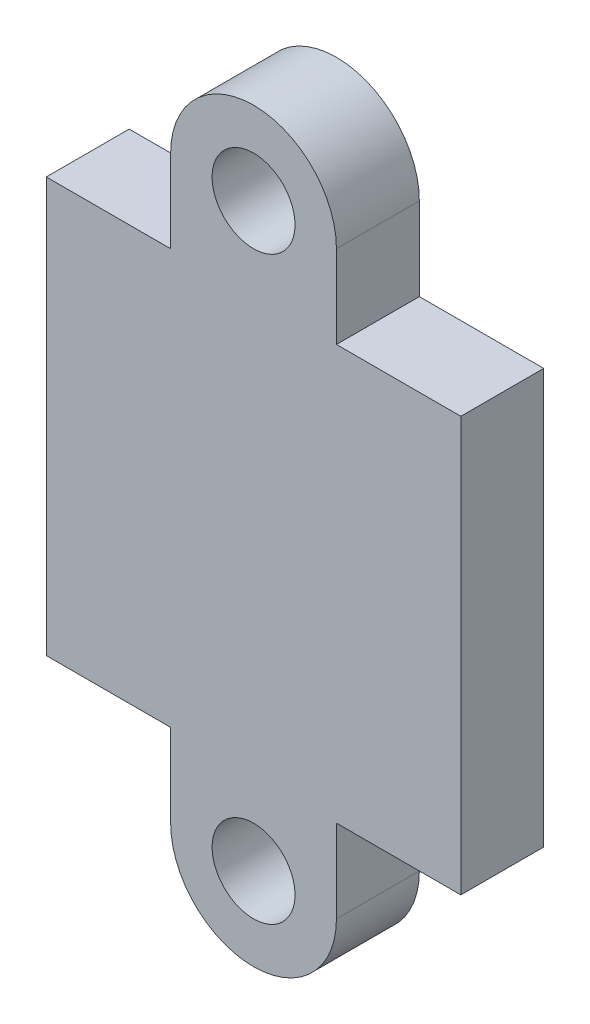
ISO-10303-21;
HEADER;
FILE_DESCRIPTION(('STEP AP214'),'2;1');
FILE_NAME('part.step','',(''),(''),'','','');
FILE_SCHEMA(('AUTOMOTIVE_DESIGN { 1 0 10303 214 1 1 1 1 }'));
ENDSEC;
DATA;
#1=APPLICATION_CONTEXT('core data for automotive mechanical design processes');
#2=APPLICATION_PROTOCOL_DEFINITION('international standard','automotive_design',2000,#1);
#3=PRODUCT_CONTEXT('',#1,'mechanical');
#4=PRODUCT('Part','Part','',(#3));
#5=PRODUCT_RELATED_PRODUCT_CATEGORY('part','',(#4));
#6=PRODUCT_DEFINITION_FORMATION('','',#4);
#7=PRODUCT_DEFINITION_CONTEXT('part definition',#1,'design');
#8=PRODUCT_DEFINITION('design','',#6,#7);
#9=PRODUCT_DEFINITION_SHAPE('','',#8);
#10=(LENGTH_UNIT() NAMED_UNIT(*) SI_UNIT(.MILLI.,.METRE.));
#11=(NAMED_UNIT(*) PLANE_ANGLE_UNIT() SI_UNIT($,.RADIAN.));
#12=(NAMED_UNIT(*) SI_UNIT($,.STERADIAN.) SOLID_ANGLE_UNIT());
#13=UNCERTAINTY_MEASURE_WITH_UNIT(LENGTH_MEASURE(1.E-05),#10,'distance_accuracy_value','');
#14=(GEOMETRIC_REPRESENTATION_CONTEXT(3) GLOBAL_UNCERTAINTY_ASSIGNED_CONTEXT((#13)) GLOBAL_UNIT_ASSIGNED_CONTEXT((#10,
#11,#12)) REPRESENTATION_CONTEXT('',''));
#15=CARTESIAN_POINT('',(0.,0.,0.));
#16=DIRECTION('',(0.,0.,1.));
#17=DIRECTION('',(1.,0.,0.));
#18=AXIS2_PLACEMENT_3D('',#15,#16,#17);
#19=CARTESIAN_POINT('',(50.,70.,10.));
#20=DIRECTION('',(0.,0.,-1.));
#21=DIRECTION('',(-1.,0.,0.));
#22=AXIS2_PLACEMENT_3D('',#19,#20,#21);
#23=PLANE('',#22);
#24=CARTESIAN_POINT('',(50.,70.,10.));
#25=DIRECTION('',(0.,0.,1.));
#26=DIRECTION('',(1.,0.,0.));
#27=AXIS2_PLACEMENT_3D('',#24,#25,#26);
#28=CIRCLE('',#27,10.);
#29=CARTESIAN_POINT('',(60.,70.,10.));
#30=VERTEX_POINT('',#29);
#31=EDGE_CURVE('E141',#30,#30,#28,.T.);
#32=ORIENTED_EDGE('',*,*,#31,.F.);
#33=EDGE_LOOP('',(#32));
#34=FACE_BOUND('',#33,.T.);
#35=DIRECTION('',(-1.,0.,0.));
#36=VECTOR('',#35,1.);
#37=CARTESIAN_POINT('',(0.,50.,10.));
#38=LINE('',#37,#36);
#39=CARTESIAN_POINT('',(30.,50.,10.));
#40=VERTEX_POINT('',#39);
#41=CARTESIAN_POINT('',(0.,50.,10.));
#42=VERTEX_POINT('',#41);
#43=EDGE_CURVE('E167',#40,#42,#38,.T.);
#44=ORIENTED_EDGE('',*,*,#43,.T.);
#45=DIRECTION('',(0.,-1.,0.));
#46=VECTOR('',#45,1.);
#47=CARTESIAN_POINT('',(0.,-50.,10.));
#48=LINE('',#47,#46);
#49=CARTESIAN_POINT('',(0.,-50.,10.));
#50=VERTEX_POINT('',#49);
#51=EDGE_CURVE('E136',#42,#50,#48,.T.);
#52=ORIENTED_EDGE('',*,*,#51,.T.);
#53=DIRECTION('',(1.,0.,0.));
#54=VECTOR('',#53,1.);
#55=CARTESIAN_POINT('',(0.,-50.,10.));
#56=LINE('',#55,#54);
#57=CARTESIAN_POINT('',(30.,-50.,10.));
#58=VERTEX_POINT('',#57);
#59=EDGE_CURVE('E170',#50,#58,#56,.T.);
#60=ORIENTED_EDGE('',*,*,#59,.T.);
#61=DIRECTION('',(0.,-1.,0.));
#62=VECTOR('',#61,1.);
#63=CARTESIAN_POINT('',(30.,-50.,10.));
#64=LINE('',#63,#62);
#65=CARTESIAN_POINT('',(30.,-70.,10.));
#66=VERTEX_POINT('',#65);
#67=EDGE_CURVE('E172',#58,#66,#64,.T.);
#68=ORIENTED_EDGE('',*,*,#67,.T.);
#69=CARTESIAN_POINT('',(50.,-70.,10.));
#70=DIRECTION('',(0.,0.,1.));
#71=DIRECTION('',(1.,0.,0.));
#72=AXIS2_PLACEMENT_3D('',#69,#70,#71);
#73=CIRCLE('',#72,20.);
#74=CARTESIAN_POINT('',(70.,-70.,10.));
#75=VERTEX_POINT('',#74);
#76=EDGE_CURVE('E174',#66,#75,#73,.T.);
#77=ORIENTED_EDGE('',*,*,#76,.T.);
#78=DIRECTION('',(0.,1.,0.));
#79=VECTOR('',#78,1.);
#80=CARTESIAN_POINT('',(70.,-70.,10.));
#81=LINE('',#80,#79);
#82=CARTESIAN_POINT('',(70.,-50.,10.));
#83=VERTEX_POINT('',#82);
#84=EDGE_CURVE('E176',#75,#83,#81,.T.);
#85=ORIENTED_EDGE('',*,*,#84,.T.);
#86=DIRECTION('',(1.,0.,0.));
#87=VECTOR('',#86,1.);
#88=CARTESIAN_POINT('',(70.,-50.,10.));
#89=LINE('',#88,#87);
#90=CARTESIAN_POINT('',(100.,-50.,10.));
#91=VERTEX_POINT('',#90);
#92=EDGE_CURVE('E178',#83,#91,#89,.T.);
#93=ORIENTED_EDGE('',*,*,#92,.T.);
#94=DIRECTION('',(0.,1.,0.));
#95=VECTOR('',#94,1.);
#96=CARTESIAN_POINT('',(100.,50.,10.));
#97=LINE('',#96,#95);
#98=CARTESIAN_POINT('',(100.,50.,10.));
#99=VERTEX_POINT('',#98);
#100=EDGE_CURVE('E180',#91,#99,#97,.T.);
#101=ORIENTED_EDGE('',*,*,#100,.T.);
#102=DIRECTION('',(-1.,0.,0.));
#103=VECTOR('',#102,1.);
#104=CARTESIAN_POINT('',(70.,50.,10.));
#105=LINE('',#104,#103);
#106=CARTESIAN_POINT('',(70.,50.,10.));
#107=VERTEX_POINT('',#106);
#108=EDGE_CURVE('E182',#99,#107,#105,.T.);
#109=ORIENTED_EDGE('',*,*,#108,.T.);
#110=DIRECTION('',(0.,1.,0.));
#111=VECTOR('',#110,1.);
#112=CARTESIAN_POINT('',(70.,70.,10.));
#113=LINE('',#112,#111);
#114=CARTESIAN_POINT('',(70.,70.,10.));
#115=VERTEX_POINT('',#114);
#116=EDGE_CURVE('E184',#107,#115,#113,.T.);
#117=ORIENTED_EDGE('',*,*,#116,.T.);
#118=CARTESIAN_POINT('',(50.,70.,10.));
#119=DIRECTION('',(0.,0.,1.));
#120=DIRECTION('',(-1.,0.,0.));
#121=AXIS2_PLACEMENT_3D('',#118,#119,#120);
#122=CIRCLE('',#121,20.);
#123=CARTESIAN_POINT('',(30.,70.,10.));
#124=VERTEX_POINT('',#123);
#125=EDGE_CURVE('E53',#115,#124,#122,.T.);
#126=ORIENTED_EDGE('',*,*,#125,.T.);
#127=DIRECTION('',(0.,-1.,0.));
#128=VECTOR('',#127,1.);
#129=CARTESIAN_POINT('',(30.,50.,10.));
#130=LINE('',#129,#128);
#131=EDGE_CURVE('E48',#124,#40,#130,.T.);
#132=ORIENTED_EDGE('',*,*,#131,.T.);
#133=EDGE_LOOP('',(#44,#52,#60,#68,#77,#85,#93,#101,#109,#117,#126,#132));
#134=FACE_BOUND('',#133,.T.);
#135=CARTESIAN_POINT('',(50.,-70.,10.));
#136=DIRECTION('',(0.,0.,1.));
#137=DIRECTION('',(-1.,0.,0.));
#138=AXIS2_PLACEMENT_3D('',#135,#136,#137);
#139=CIRCLE('',#138,10.);
#140=CARTESIAN_POINT('',(40.,-70.,10.));
#141=VERTEX_POINT('',#140);
#142=EDGE_CURVE('E287',#141,#141,#139,.T.);
#143=ORIENTED_EDGE('',*,*,#142,.F.);
#144=EDGE_LOOP('',(#143));
#145=FACE_BOUND('',#144,.T.);
#146=ADVANCED_FACE('F33',(#34,#134,#145),#23,.F.);
#147=CARTESIAN_POINT('',(50.,70.,-10.));
#148=DIRECTION('',(0.,0.,-1.));
#149=DIRECTION('',(-1.,0.,0.));
#150=AXIS2_PLACEMENT_3D('',#147,#148,#149);
#151=PLANE('',#150);
#152=CARTESIAN_POINT('',(50.,70.,-10.));
#153=DIRECTION('',(0.,0.,1.));
#154=DIRECTION('',(1.,0.,0.));
#155=AXIS2_PLACEMENT_3D('',#152,#153,#154);
#156=CIRCLE('',#155,10.);
#157=CARTESIAN_POINT('',(60.,70.,-10.));
#158=VERTEX_POINT('',#157);
#159=EDGE_CURVE('E144',#158,#158,#156,.T.);
#160=ORIENTED_EDGE('',*,*,#159,.T.);
#161=EDGE_LOOP('',(#160));
#162=FACE_BOUND('',#161,.T.);
#163=DIRECTION('',(-1.,0.,0.));
#164=VECTOR('',#163,1.);
#165=CARTESIAN_POINT('',(0.,50.,-10.));
#166=LINE('',#165,#164);
#167=CARTESIAN_POINT('',(30.,50.,-10.));
#168=VERTEX_POINT('',#167);
#169=CARTESIAN_POINT('',(0.,50.,-10.));
#170=VERTEX_POINT('',#169);
#171=EDGE_CURVE('E127',#168,#170,#166,.T.);
#172=ORIENTED_EDGE('',*,*,#171,.F.);
#173=DIRECTION('',(0.,-1.,0.));
#174=VECTOR('',#173,1.);
#175=CARTESIAN_POINT('',(30.,50.,-10.));
#176=LINE('',#175,#174);
#177=CARTESIAN_POINT('',(30.,70.,-10.));
#178=VERTEX_POINT('',#177);
#179=EDGE_CURVE('E165',#178,#168,#176,.T.);
#180=ORIENTED_EDGE('',*,*,#179,.F.);
#181=CARTESIAN_POINT('',(50.,70.,-10.));
#182=DIRECTION('',(0.,0.,1.));
#183=DIRECTION('',(-1.,0.,0.));
#184=AXIS2_PLACEMENT_3D('',#181,#182,#183);
#185=CIRCLE('',#184,20.);
#186=CARTESIAN_POINT('',(70.,70.,-10.));
#187=VERTEX_POINT('',#186);
#188=EDGE_CURVE('E163',#187,#178,#185,.T.);
#189=ORIENTED_EDGE('',*,*,#188,.F.);
#190=DIRECTION('',(0.,1.,0.));
#191=VECTOR('',#190,1.);
#192=CARTESIAN_POINT('',(70.,70.,-10.));
#193=LINE('',#192,#191);
#194=CARTESIAN_POINT('',(70.,50.,-10.));
#195=VERTEX_POINT('',#194);
#196=EDGE_CURVE('E161',#195,#187,#193,.T.);
#197=ORIENTED_EDGE('',*,*,#196,.F.);
#198=DIRECTION('',(-1.,0.,0.));
#199=VECTOR('',#198,1.);
#200=CARTESIAN_POINT('',(70.,50.,-10.));
#201=LINE('',#200,#199);
#202=CARTESIAN_POINT('',(100.,50.,-10.));
#203=VERTEX_POINT('',#202);
#204=EDGE_CURVE('E159',#203,#195,#201,.T.);
#205=ORIENTED_EDGE('',*,*,#204,.F.);
#206=DIRECTION('',(0.,1.,0.));
#207=VECTOR('',#206,1.);
#208=CARTESIAN_POINT('',(100.,50.,-10.));
#209=LINE('',#208,#207);
#210=CARTESIAN_POINT('',(100.,-50.,-10.));
#211=VERTEX_POINT('',#210);
#212=EDGE_CURVE('E157',#211,#203,#209,.T.);
#213=ORIENTED_EDGE('',*,*,#212,.F.);
#214=DIRECTION('',(1.,0.,0.));
#215=VECTOR('',#214,1.);
#216=CARTESIAN_POINT('',(70.,-50.,-10.));
#217=LINE('',#216,#215);
#218=CARTESIAN_POINT('',(70.,-50.,-10.));
#219=VERTEX_POINT('',#218);
#220=EDGE_CURVE('E155',#219,#211,#217,.T.);
#221=ORIENTED_EDGE('',*,*,#220,.F.);
#222=DIRECTION('',(0.,1.,0.));
#223=VECTOR('',#222,1.);
#224=CARTESIAN_POINT('',(70.,-70.,-10.));
#225=LINE('',#224,#223);
#226=CARTESIAN_POINT('',(70.,-70.,-10.));
#227=VERTEX_POINT('',#226);
#228=EDGE_CURVE('E153',#227,#219,#225,.T.);
#229=ORIENTED_EDGE('',*,*,#228,.F.);
#230=CARTESIAN_POINT('',(50.,-70.,-10.));
#231=DIRECTION('',(0.,0.,1.));
#232=DIRECTION('',(1.,0.,0.));
#233=AXIS2_PLACEMENT_3D('',#230,#231,#232);
#234=CIRCLE('',#233,20.);
#235=CARTESIAN_POINT('',(30.,-70.,-10.));
#236=VERTEX_POINT('',#235);
#237=EDGE_CURVE('E151',#236,#227,#234,.T.);
#238=ORIENTED_EDGE('',*,*,#237,.F.);
#239=DIRECTION('',(0.,-1.,0.));
#240=VECTOR('',#239,1.);
#241=CARTESIAN_POINT('',(30.,-50.,-10.));
#242=LINE('',#241,#240);
#243=CARTESIAN_POINT('',(30.,-50.,-10.));
#244=VERTEX_POINT('',#243);
#245=EDGE_CURVE('E149',#244,#236,#242,.T.);
#246=ORIENTED_EDGE('',*,*,#245,.F.);
#247=DIRECTION('',(1.,0.,0.));
#248=VECTOR('',#247,1.);
#249=CARTESIAN_POINT('',(0.,-50.,-10.));
#250=LINE('',#249,#248);
#251=CARTESIAN_POINT('',(0.,-50.,-10.));
#252=VERTEX_POINT('',#251);
#253=EDGE_CURVE('E129',#252,#244,#250,.T.);
#254=ORIENTED_EDGE('',*,*,#253,.F.);
#255=DIRECTION('',(0.,-1.,0.));
#256=VECTOR('',#255,1.);
#257=CARTESIAN_POINT('',(0.,-50.,-10.));
#258=LINE('',#257,#256);
#259=EDGE_CURVE('E122',#170,#252,#258,.T.);
#260=ORIENTED_EDGE('',*,*,#259,.F.);
#261=EDGE_LOOP('',(#172,#180,#189,#197,#205,#213,#221,#229,#238,#246,#254,#260));
#262=FACE_BOUND('',#261,.T.);
#263=CARTESIAN_POINT('',(50.,-70.,-10.));
#264=DIRECTION('',(0.,0.,1.));
#265=DIRECTION('',(-1.,0.,0.));
#266=AXIS2_PLACEMENT_3D('',#263,#264,#265);
#267=CIRCLE('',#266,10.);
#268=CARTESIAN_POINT('',(40.,-70.,-10.));
#269=VERTEX_POINT('',#268);
#270=EDGE_CURVE('E290',#269,#269,#267,.T.);
#271=ORIENTED_EDGE('',*,*,#270,.T.);
#272=EDGE_LOOP('',(#271));
#273=FACE_BOUND('',#272,.T.);
#274=ADVANCED_FACE('F123',(#162,#262,#273),#151,.T.);
#275=CARTESIAN_POINT('',(0.,50.,10.));
#276=DIRECTION('',(0.,-1.,0.));
#277=DIRECTION('',(0.,0.,-1.));
#278=AXIS2_PLACEMENT_3D('',#275,#276,#277);
#279=PLANE('',#278);
#280=ORIENTED_EDGE('',*,*,#171,.T.);
#281=DIRECTION('',(0.,0.,-1.));
#282=VECTOR('',#281,1.);
#283=CARTESIAN_POINT('',(0.,50.,10.));
#284=LINE('',#283,#282);
#285=EDGE_CURVE('E11',#42,#170,#284,.T.);
#286=ORIENTED_EDGE('',*,*,#285,.F.);
#287=ORIENTED_EDGE('',*,*,#43,.F.);
#288=DIRECTION('',(0.,0.,-1.));
#289=VECTOR('',#288,1.);
#290=CARTESIAN_POINT('',(30.,50.,10.));
#291=LINE('',#290,#289);
#292=EDGE_CURVE('E140',#40,#168,#291,.T.);
#293=ORIENTED_EDGE('',*,*,#292,.T.);
#294=EDGE_LOOP('',(#280,#286,#287,#293));
#295=FACE_BOUND('',#294,.T.);
#296=ADVANCED_FACE('F35',(#295),#279,.F.);
#297=CARTESIAN_POINT('',(0.,-50.,10.));
#298=DIRECTION('',(1.,0.,0.));
#299=DIRECTION('',(0.,0.,-1.));
#300=AXIS2_PLACEMENT_3D('',#297,#298,#299);
#301=PLANE('',#300);
#302=ORIENTED_EDGE('',*,*,#259,.T.);
#303=DIRECTION('',(0.,0.,-1.));
#304=VECTOR('',#303,1.);
#305=CARTESIAN_POINT('',(0.,-50.,10.));
#306=LINE('',#305,#304);
#307=EDGE_CURVE('E41',#50,#252,#306,.T.);
#308=ORIENTED_EDGE('',*,*,#307,.F.);
#309=ORIENTED_EDGE('',*,*,#51,.F.);
#310=ORIENTED_EDGE('',*,*,#285,.T.);
#311=EDGE_LOOP('',(#302,#308,#309,#310));
#312=FACE_BOUND('',#311,.T.);
#313=ADVANCED_FACE('F135',(#312),#301,.F.);
#314=CARTESIAN_POINT('',(0.,-50.,10.));
#315=DIRECTION('',(0.,1.,0.));
#316=DIRECTION('',(0.,0.,1.));
#317=AXIS2_PLACEMENT_3D('',#314,#315,#316);
#318=PLANE('',#317);
#319=ORIENTED_EDGE('',*,*,#253,.T.);
#320=DIRECTION('',(0.,0.,-1.));
#321=VECTOR('',#320,1.);
#322=CARTESIAN_POINT('',(30.,-50.,10.));
#323=LINE('',#322,#321);
#324=EDGE_CURVE('E213',#58,#244,#323,.T.);
#325=ORIENTED_EDGE('',*,*,#324,.F.);
#326=ORIENTED_EDGE('',*,*,#59,.F.);
#327=ORIENTED_EDGE('',*,*,#307,.T.);
#328=EDGE_LOOP('',(#319,#325,#326,#327));
#329=FACE_BOUND('',#328,.T.);
#330=ADVANCED_FACE('F217',(#329),#318,.F.);
#331=CARTESIAN_POINT('',(30.,-50.,10.));
#332=DIRECTION('',(1.,0.,0.));
#333=DIRECTION('',(0.,0.,-1.));
#334=AXIS2_PLACEMENT_3D('',#331,#332,#333);
#335=PLANE('',#334);
#336=ORIENTED_EDGE('',*,*,#245,.T.);
#337=DIRECTION('',(0.,0.,-1.));
#338=VECTOR('',#337,1.);
#339=CARTESIAN_POINT('',(30.,-70.,10.));
#340=LINE('',#339,#338);
#341=EDGE_CURVE('E210',#66,#236,#340,.T.);
#342=ORIENTED_EDGE('',*,*,#341,.F.);
#343=ORIENTED_EDGE('',*,*,#67,.F.);
#344=ORIENTED_EDGE('',*,*,#324,.T.);
#345=EDGE_LOOP('',(#336,#342,#343,#344));
#346=FACE_BOUND('',#345,.T.);
#347=ADVANCED_FACE('F225',(#346),#335,.F.);
#348=CARTESIAN_POINT('',(50.,-70.,10.));
#349=DIRECTION('',(0.,0.,-1.));
#350=DIRECTION('',(-1.,0.,0.));
#351=AXIS2_PLACEMENT_3D('',#348,#349,#350);
#352=CYLINDRICAL_SURFACE('',#351,20.);
#353=ORIENTED_EDGE('',*,*,#237,.T.);
#354=DIRECTION('',(0.,0.,-1.));
#355=VECTOR('',#354,1.);
#356=CARTESIAN_POINT('',(70.,-70.,10.));
#357=LINE('',#356,#355);
#358=EDGE_CURVE('E207',#75,#227,#357,.T.);
#359=ORIENTED_EDGE('',*,*,#358,.F.);
#360=ORIENTED_EDGE('',*,*,#76,.F.);
#361=ORIENTED_EDGE('',*,*,#341,.T.);
#362=EDGE_LOOP('',(#353,#359,#360,#361));
#363=FACE_BOUND('',#362,.T.);
#364=ADVANCED_FACE('F228',(#363),#352,.T.);
#365=CARTESIAN_POINT('',(70.,-70.,10.));
#366=DIRECTION('',(-1.,0.,0.));
#367=DIRECTION('',(0.,-1.,0.));
#368=AXIS2_PLACEMENT_3D('',#365,#366,#367);
#369=PLANE('',#368);
#370=ORIENTED_EDGE('',*,*,#228,.T.);
#371=DIRECTION('',(0.,0.,-1.));
#372=VECTOR('',#371,1.);
#373=CARTESIAN_POINT('',(70.,-50.,10.));
#374=LINE('',#373,#372);
#375=EDGE_CURVE('E204',#83,#219,#374,.T.);
#376=ORIENTED_EDGE('',*,*,#375,.F.);
#377=ORIENTED_EDGE('',*,*,#84,.F.);
#378=ORIENTED_EDGE('',*,*,#358,.T.);
#379=EDGE_LOOP('',(#370,#376,#377,#378));
#380=FACE_BOUND('',#379,.T.);
#381=ADVANCED_FACE('F233',(#380),#369,.F.);
#382=CARTESIAN_POINT('',(70.,-50.,10.));
#383=DIRECTION('',(0.,1.,0.));
#384=DIRECTION('',(0.,0.,1.));
#385=AXIS2_PLACEMENT_3D('',#382,#383,#384);
#386=PLANE('',#385);
#387=ORIENTED_EDGE('',*,*,#220,.T.);
#388=DIRECTION('',(0.,0.,-1.));
#389=VECTOR('',#388,1.);
#390=CARTESIAN_POINT('',(100.,-50.,10.));
#391=LINE('',#390,#389);
#392=EDGE_CURVE('E201',#91,#211,#391,.T.);
#393=ORIENTED_EDGE('',*,*,#392,.F.);
#394=ORIENTED_EDGE('',*,*,#92,.F.);
#395=ORIENTED_EDGE('',*,*,#375,.T.);
#396=EDGE_LOOP('',(#387,#393,#394,#395));
#397=FACE_BOUND('',#396,.T.);
#398=ADVANCED_FACE('F239',(#397),#386,.F.);
#399=CARTESIAN_POINT('',(100.,50.,10.));
#400=DIRECTION('',(-1.,0.,0.));
#401=DIRECTION('',(0.,0.,1.));
#402=AXIS2_PLACEMENT_3D('',#399,#400,#401);
#403=PLANE('',#402);
#404=ORIENTED_EDGE('',*,*,#212,.T.);
#405=DIRECTION('',(0.,0.,-1.));
#406=VECTOR('',#405,1.);
#407=CARTESIAN_POINT('',(100.,50.,10.));
#408=LINE('',#407,#406);
#409=EDGE_CURVE('E198',#99,#203,#408,.T.);
#410=ORIENTED_EDGE('',*,*,#409,.F.);
#411=ORIENTED_EDGE('',*,*,#100,.F.);
#412=ORIENTED_EDGE('',*,*,#392,.T.);
#413=EDGE_LOOP('',(#404,#410,#411,#412));
#414=FACE_BOUND('',#413,.T.);
#415=ADVANCED_FACE('F243',(#414),#403,.F.);
#416=CARTESIAN_POINT('',(70.,50.,10.));
#417=DIRECTION('',(0.,-1.,0.));
#418=DIRECTION('',(0.,0.,-1.));
#419=AXIS2_PLACEMENT_3D('',#416,#417,#418);
#420=PLANE('',#419);
#421=ORIENTED_EDGE('',*,*,#204,.T.);
#422=DIRECTION('',(0.,0.,-1.));
#423=VECTOR('',#422,1.);
#424=CARTESIAN_POINT('',(70.,50.,10.));
#425=LINE('',#424,#423);
#426=EDGE_CURVE('E195',#107,#195,#425,.T.);
#427=ORIENTED_EDGE('',*,*,#426,.F.);
#428=ORIENTED_EDGE('',*,*,#108,.F.);
#429=ORIENTED_EDGE('',*,*,#409,.T.);
#430=EDGE_LOOP('',(#421,#427,#428,#429));
#431=FACE_BOUND('',#430,.T.);
#432=ADVANCED_FACE('F248',(#431),#420,.F.);
#433=CARTESIAN_POINT('',(70.,70.,10.));
#434=DIRECTION('',(-1.,0.,0.));
#435=DIRECTION('',(0.,-1.,0.));
#436=AXIS2_PLACEMENT_3D('',#433,#434,#435);
#437=PLANE('',#436);
#438=ORIENTED_EDGE('',*,*,#196,.T.);
#439=DIRECTION('',(0.,0.,-1.));
#440=VECTOR('',#439,1.);
#441=CARTESIAN_POINT('',(70.,70.,10.));
#442=LINE('',#441,#440);
#443=EDGE_CURVE('E192',#115,#187,#442,.T.);
#444=ORIENTED_EDGE('',*,*,#443,.F.);
#445=ORIENTED_EDGE('',*,*,#116,.F.);
#446=ORIENTED_EDGE('',*,*,#426,.T.);
#447=EDGE_LOOP('',(#438,#444,#445,#446));
#448=FACE_BOUND('',#447,.T.);
#449=ADVANCED_FACE('F252',(#448),#437,.F.);
#450=CARTESIAN_POINT('',(50.,70.,10.));
#451=DIRECTION('',(0.,0.,-1.));
#452=DIRECTION('',(-1.,0.,0.));
#453=AXIS2_PLACEMENT_3D('',#450,#451,#452);
#454=CYLINDRICAL_SURFACE('',#453,20.);
#455=ORIENTED_EDGE('',*,*,#188,.T.);
#456=DIRECTION('',(0.,0.,-1.));
#457=VECTOR('',#456,1.);
#458=CARTESIAN_POINT('',(30.,70.,10.));
#459=LINE('',#458,#457);
#460=EDGE_CURVE('E189',#124,#178,#459,.T.);
#461=ORIENTED_EDGE('',*,*,#460,.F.);
#462=ORIENTED_EDGE('',*,*,#125,.F.);
#463=ORIENTED_EDGE('',*,*,#443,.T.);
#464=EDGE_LOOP('',(#455,#461,#462,#463));
#465=FACE_BOUND('',#464,.T.);
#466=ADVANCED_FACE('F256',(#465),#454,.T.);
#467=CARTESIAN_POINT('',(30.,50.,10.));
#468=DIRECTION('',(1.,0.,0.));
#469=DIRECTION('',(0.,0.,-1.));
#470=AXIS2_PLACEMENT_3D('',#467,#468,#469);
#471=PLANE('',#470);
#472=ORIENTED_EDGE('',*,*,#179,.T.);
#473=ORIENTED_EDGE('',*,*,#292,.F.);
#474=ORIENTED_EDGE('',*,*,#131,.F.);
#475=ORIENTED_EDGE('',*,*,#460,.T.);
#476=EDGE_LOOP('',(#472,#473,#474,#475));
#477=FACE_BOUND('',#476,.T.);
#478=ADVANCED_FACE('F258',(#477),#471,.F.);
#479=CARTESIAN_POINT('',(50.,70.,10.));
#480=DIRECTION('',(0.,0.,-1.));
#481=DIRECTION('',(-1.,0.,0.));
#482=AXIS2_PLACEMENT_3D('',#479,#480,#481);
#483=CYLINDRICAL_SURFACE('',#482,10.);
#484=ORIENTED_EDGE('',*,*,#31,.T.);
#485=EDGE_LOOP('',(#484));
#486=FACE_BOUND('',#485,.T.);
#487=ORIENTED_EDGE('',*,*,#159,.F.);
#488=EDGE_LOOP('',(#487));
#489=FACE_BOUND('',#488,.T.);
#490=ADVANCED_FACE('F260',(#486,#489),#483,.F.);
#491=CARTESIAN_POINT('',(50.,-70.,10.));
#492=DIRECTION('',(0.,0.,-1.));
#493=DIRECTION('',(-1.,0.,0.));
#494=AXIS2_PLACEMENT_3D('',#491,#492,#493);
#495=CYLINDRICAL_SURFACE('',#494,10.);
#496=ORIENTED_EDGE('',*,*,#142,.T.);
#497=EDGE_LOOP('',(#496));
#498=FACE_BOUND('',#497,.T.);
#499=ORIENTED_EDGE('',*,*,#270,.F.);
#500=EDGE_LOOP('',(#499));
#501=FACE_BOUND('',#500,.T.);
#502=ADVANCED_FACE('F266',(#498,#501),#495,.F.);
#503=CLOSED_SHELL('',(#146,#274,#296,#313,#330,#347,#364,#381,#398,#415,#432,#449,#466,#478,
#490,#502));
#504=MANIFOLD_SOLID_BREP('B2',#503);
#505=ADVANCED_BREP_SHAPE_REPRESENTATION('',(#18,#504),#14);
#506=SHAPE_DEFINITION_REPRESENTATION(#9,#505);
ENDSEC;
END-ISO-10303-21;
